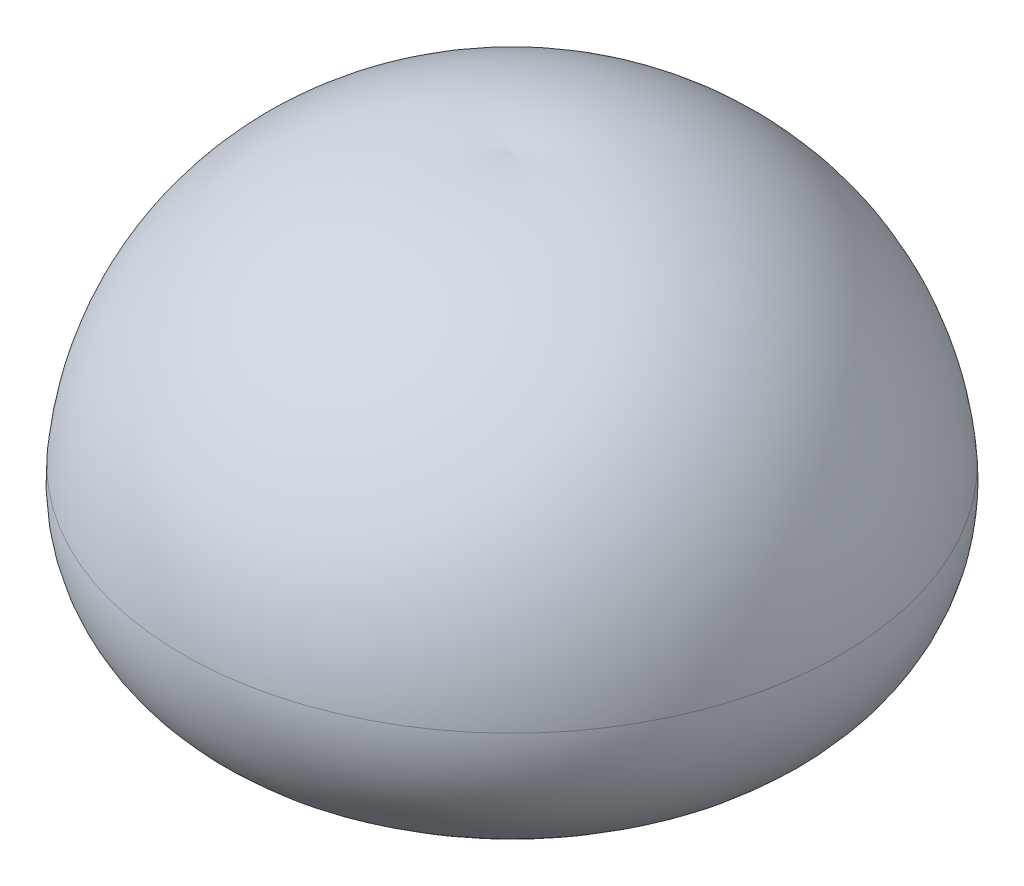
from build123d import *


with BuildPart() as part:
    # Sketch 1 → Revolve 1 (revolve)
    with BuildSketch(Plane.XY):
        with BuildLine():
            Line((0, 3438.048534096), (0, 2059.180757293))
            ThreePointArc((0, 2059.180757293), (153.770033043, 2083.23642391), (309.235002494, 2090.621641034))
            ThreePointArc((309.235002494, 2090.621641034), (503.033087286, 1584.794759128), (493.925439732, 1043.190122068))
            ThreePointArc((493.925439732, 1043.190122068), (738.075173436, 579.788099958), (369.53805081, 207.590684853))
            ThreePointArc((369.53805081, 207.590684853), (2025.136633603, -615.880415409), (3098.424233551, 889.830396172))
            ThreePointArc((3098.424233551, 889.830396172), (2084.344370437, 2814.616390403), (0, 3438.048534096))
        make_face()
    revolve(axis=Axis((0, 2059.180757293, 0), (0, 1, 0)))

    # Sketch 2 → Revolve 2 (revolve)
    with BuildSketch(Plane.XY, mode=Mode.PRIVATE) as revolve_2_sk:
        with BuildLine():
            ThreePointArc((-947.327564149, -85.808567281), (-1022.422189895, 1229.043462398), (0, 2059.180757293))
            Line((0, 2059.180757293), (0, 3438.048534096))
            ThreePointArc((0, 3438.048534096), (-1232.637227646, 2999.175703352), (-2132.763877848, 2049.55687975))
            ThreePointArc((-2132.763877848, 2049.55687975), (-2144.561823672, 646.280386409), (-947.327564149, -85.808567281))
        make_face()
    revolve(revolve_2_sk.sketch.rotate(Axis((0, 2059.180757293, 0), (0, 1, 0)), 180), axis=Axis((0, 2059.180757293, 0), (0, 1, 0)))


solid = part.part
